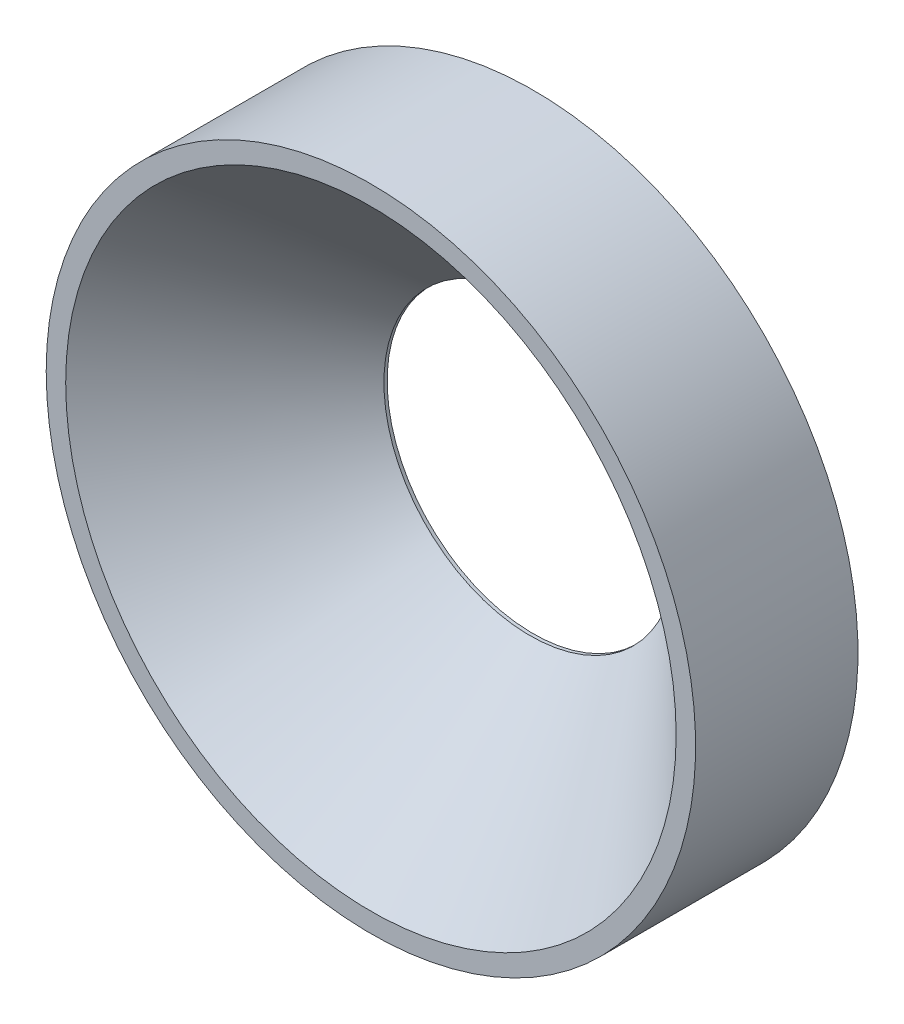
from build123d import *

# Parameters (mm, degrees)
ESQUISSE1_R                                     = 5
EXTRUSION1_DEPTH                                = 2.5
FRAISAGE_POUR_VIS_T_TE_FRAIS_E_FOND_D           = 4.5
FRAISAGE_POUR_VIS_T_TE_FRAIS_E_FOND_DEPTH       = 10
FRAISAGE_POUR_VIS_T_TE_FRAIS_E_FOND_CSINK_D     = 9.4
FRAISAGE_POUR_VIS_T_TE_FRAIS_E_FOND_CSINK_ANGLE = 90
FRAISAGE_POUR_VIS_T_TE_FRAIS_E_FOND_TIP         = 1.351936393


with BuildPart() as part:
    # Esquisse1 → Extrusion1 (new body)
    with BuildSketch(Plane.XY):
        with Locations(Location((0, 0, 0), (0, 0, 180))):
            Circle(ESQUISSE1_R)
    extrude(amount=EXTRUSION1_DEPTH)

    # Fraisage pour vis _ t_te frais_e _ fond
    with Locations(Plane.XY.offset(2.5)):
        with Locations((0, 0)):
            CounterSinkHole(FRAISAGE_POUR_VIS_T_TE_FRAIS_E_FOND_D / 2, FRAISAGE_POUR_VIS_T_TE_FRAIS_E_FOND_CSINK_D / 2, depth=FRAISAGE_POUR_VIS_T_TE_FRAIS_E_FOND_DEPTH, counter_sink_angle=FRAISAGE_POUR_VIS_T_TE_FRAIS_E_FOND_CSINK_ANGLE)
            with Locations((0, 0, -(FRAISAGE_POUR_VIS_T_TE_FRAIS_E_FOND_DEPTH + FRAISAGE_POUR_VIS_T_TE_FRAIS_E_FOND_TIP / 2))):  # 118° drill point
                Cone(0, FRAISAGE_POUR_VIS_T_TE_FRAIS_E_FOND_D / 2, FRAISAGE_POUR_VIS_T_TE_FRAIS_E_FOND_TIP, mode=Mode.SUBTRACT)


solid = part.part
